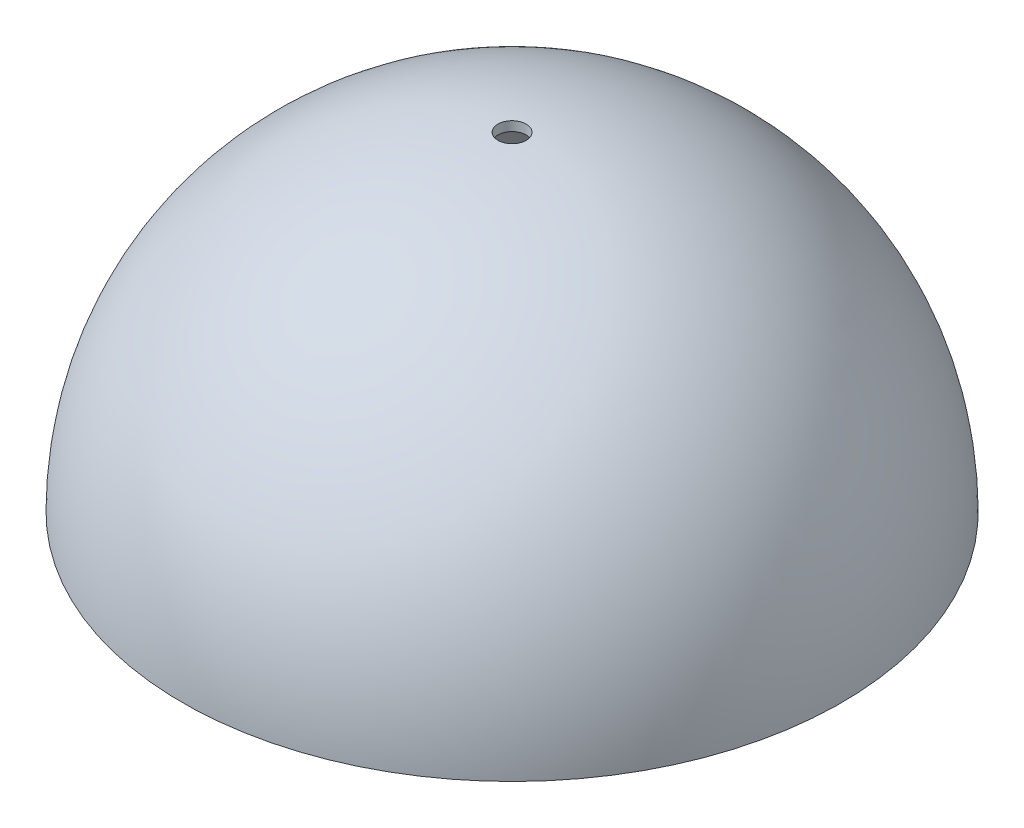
from build123d import *

# Parameters (mm, degrees)
ESQUISSE2_R             = 1.5
ENL_V_MAT_EXTRU_2_DEPTH = 61.621778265


with BuildPart() as part:
    # Esquisse1 → R_vol.-Mince1 (revolve)
    with BuildSketch(Plane.XY, mode=Mode.PRIVATE) as r_vol_mince1_sk:
        with BuildLine():
            ThreePointArc((0, 35), (24.748737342, 24.748737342), (35, 0))
            Line((35, 0), (34, 0))
            ThreePointArc((34, 0), (24.04163056, 24.04163056), (0, 34))
            Line((0, 34), (0, 35))
        make_face()
    revolve(r_vol_mince1_sk.sketch.rotate(Axis((0, 0, 0), (0, 1, 0)), 180), axis=Axis((0, 0, 0), (0, 1, 0)))

    # Esquisse2 → Enl_v. mat.-Extru.2 (cut, through all)
    with BuildSketch(Plane(origin=(0, 0, 0), x_dir=(1, 0, 0), z_dir=(0, 1, 0))):
        with Locations(Location((0, 0, 0), (0, 0, 90))):
            Circle(ESQUISSE2_R)
    extrude(amount=ENL_V_MAT_EXTRU_2_DEPTH, mode=Mode.SUBTRACT)


solid = part.part
